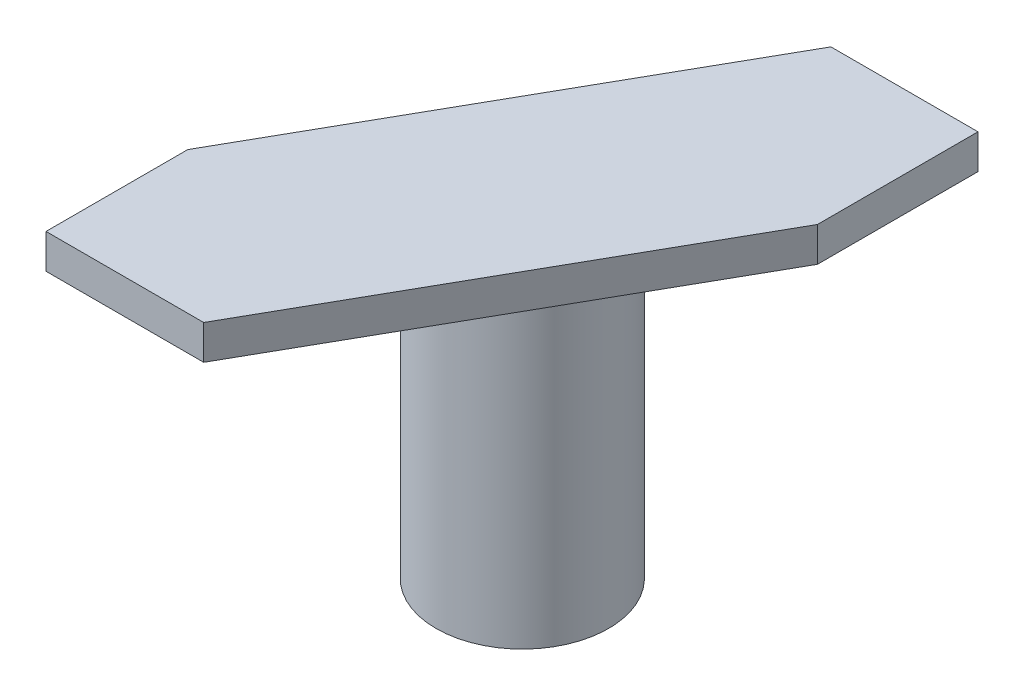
from build123d import *

# Parameters (mm, degrees)
DODANIE_WYCI_GNI_CIE1_DEPTH = 1
SZKIC2_R                    = 2.5
DODANIE_WYCI_GNI_CIE2_DEPTH = 9


with BuildPart() as part:
    # Szkic1 → Dodanie-wyci_gni_cie1 (new body)
    with BuildSketch(Plane(origin=(0, 0, 0), x_dir=(1, 0, 0), z_dir=(0, 1, 0))):
        Polygon((1.127230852, 4.651075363), (5.387944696, 4.651075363), (5.387944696, 0), (-1.043465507, -11.348924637), (-5.612055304, -11.348924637), (-5.612055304, -7.241129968), align=None)
    extrude(amount=DODANIE_WYCI_GNI_CIE1_DEPTH)

    # Szkic2 → Dodanie-wyci_gni_cie2 (add)
    with BuildSketch(Plane(origin=(0, 0, 0), x_dir=(1, 0, 0), z_dir=(0, 1, 0))):
        with Locations(Location((0, -3.161899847, 0), (0, 0, 270))):
            Circle(SZKIC2_R)
    extrude(amount=-DODANIE_WYCI_GNI_CIE2_DEPTH)


solid = part.part
